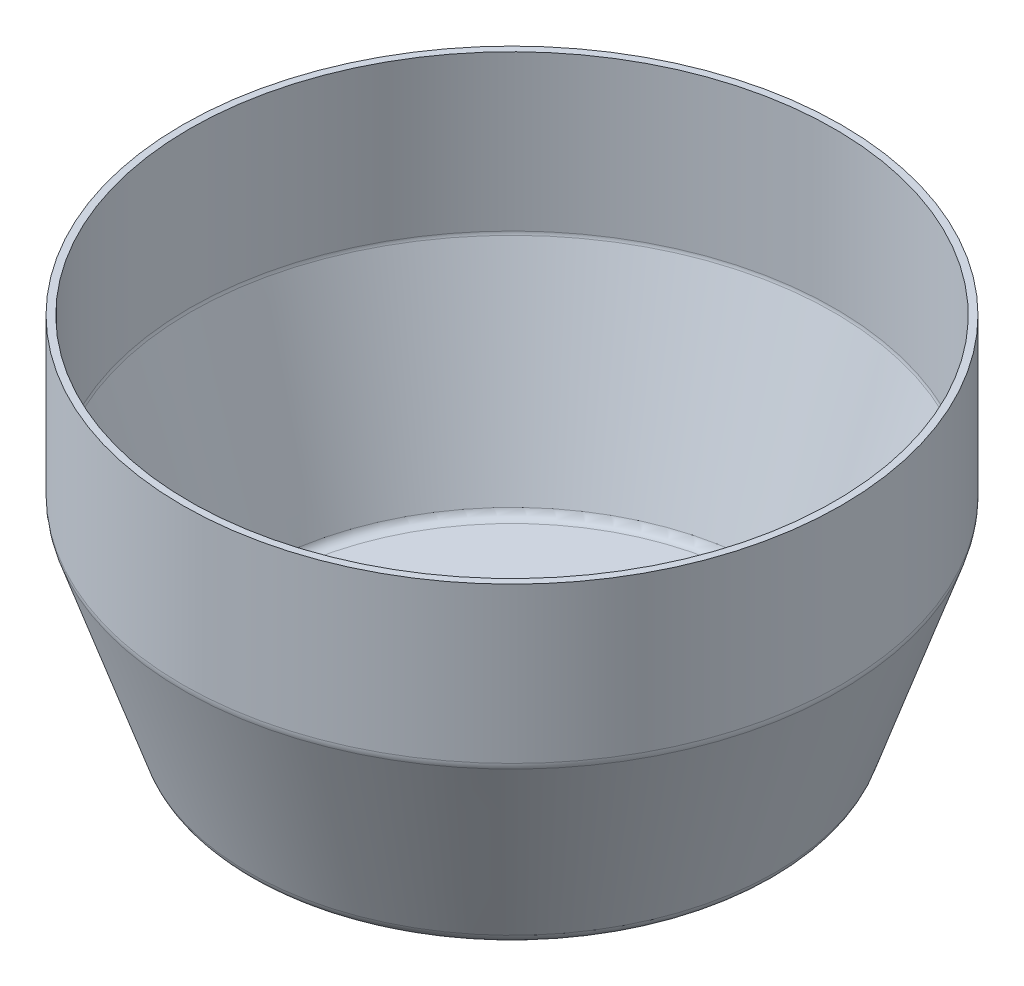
ISO-10303-21;
HEADER;
FILE_DESCRIPTION(('STEP AP214'),'2;1');
FILE_NAME('part.step','',(''),(''),'','','');
FILE_SCHEMA(('AUTOMOTIVE_DESIGN { 1 0 10303 214 1 1 1 1 }'));
ENDSEC;
DATA;
#1=APPLICATION_CONTEXT('core data for automotive mechanical design processes');
#2=APPLICATION_PROTOCOL_DEFINITION('international standard','automotive_design',2000,#1);
#3=PRODUCT_CONTEXT('',#1,'mechanical');
#4=PRODUCT('Part','Part','',(#3));
#5=PRODUCT_RELATED_PRODUCT_CATEGORY('part','',(#4));
#6=PRODUCT_DEFINITION_FORMATION('','',#4);
#7=PRODUCT_DEFINITION_CONTEXT('part definition',#1,'design');
#8=PRODUCT_DEFINITION('design','',#6,#7);
#9=PRODUCT_DEFINITION_SHAPE('','',#8);
#10=(LENGTH_UNIT() NAMED_UNIT(*) SI_UNIT(.MILLI.,.METRE.));
#11=(NAMED_UNIT(*) PLANE_ANGLE_UNIT() SI_UNIT($,.RADIAN.));
#12=(NAMED_UNIT(*) SI_UNIT($,.STERADIAN.) SOLID_ANGLE_UNIT());
#13=UNCERTAINTY_MEASURE_WITH_UNIT(LENGTH_MEASURE(1.E-05),#10,'distance_accuracy_value','');
#14=(GEOMETRIC_REPRESENTATION_CONTEXT(3) GLOBAL_UNCERTAINTY_ASSIGNED_CONTEXT((#13)) GLOBAL_UNIT_ASSIGNED_CONTEXT((#10,
#11,#12)) REPRESENTATION_CONTEXT('',''));
#15=CARTESIAN_POINT('',(0.,0.,0.));
#16=DIRECTION('',(0.,0.,1.));
#17=DIRECTION('',(1.,0.,0.));
#18=AXIS2_PLACEMENT_3D('',#15,#16,#17);
#19=CARTESIAN_POINT('',(-95.5,0.,0.));
#20=DIRECTION('',(0.,1.,0.));
#21=DIRECTION('',(-1.,0.,0.));
#22=AXIS2_PLACEMENT_3D('',#19,#20,#21);
#23=PLANE('',#22);
#24=CARTESIAN_POINT('',(0.,0.,0.));
#25=DIRECTION('',(0.,1.,0.));
#26=DIRECTION('',(-1.,0.,0.));
#27=AXIS2_PLACEMENT_3D('',#24,#25,#26);
#28=CIRCLE('',#27,95.5);
#29=CARTESIAN_POINT('',(-95.5,0.,0.));
#30=VERTEX_POINT('',#29);
#31=EDGE_CURVE('E66',#30,#30,#28,.T.);
#32=ORIENTED_EDGE('',*,*,#31,.T.);
#33=EDGE_LOOP('',(#32));
#34=FACE_BOUND('',#33,.T.);
#35=CARTESIAN_POINT('',(0.,0.,0.));
#36=DIRECTION('',(0.,1.,0.));
#37=DIRECTION('',(-1.,0.,0.));
#38=AXIS2_PLACEMENT_3D('',#35,#36,#37);
#39=CIRCLE('',#38,93.5);
#40=CARTESIAN_POINT('',(-93.5,0.,0.));
#41=VERTEX_POINT('',#40);
#42=EDGE_CURVE('E10',#41,#41,#39,.T.);
#43=ORIENTED_EDGE('',*,*,#42,.F.);
#44=EDGE_LOOP('',(#43));
#45=FACE_BOUND('',#44,.T.);
#46=ADVANCED_FACE('F32',(#34,#45),#23,.T.);
#47=CARTESIAN_POINT('',(0.,38.398623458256,0.));
#48=DIRECTION('',(0.,1.,0.));
#49=DIRECTION('',(-1.,0.,0.));
#50=AXIS2_PLACEMENT_3D('',#47,#48,#49);
#51=CYLINDRICAL_SURFACE('',#50,93.5);
#52=ORIENTED_EDGE('',*,*,#42,.T.);
#53=EDGE_LOOP('',(#52));
#54=FACE_BOUND('',#53,.T.);
#55=CARTESIAN_POINT('',(0.,-45.,0.));
#56=DIRECTION('',(0.,1.,0.));
#57=DIRECTION('',(-1.,0.,0.));
#58=AXIS2_PLACEMENT_3D('',#55,#56,#57);
#59=CIRCLE('',#58,93.5);
#60=CARTESIAN_POINT('',(-93.5,-45.,0.));
#61=VERTEX_POINT('',#60);
#62=EDGE_CURVE('E38',#61,#61,#59,.T.);
#63=ORIENTED_EDGE('',*,*,#62,.F.);
#64=EDGE_LOOP('',(#63));
#65=FACE_BOUND('',#64,.T.);
#66=ADVANCED_FACE('F160',(#54,#65),#51,.F.);
#67=CARTESIAN_POINT('',(0.,-45.,0.));
#68=DIRECTION('',(0.,1.,0.));
#69=DIRECTION('',(-1.,0.,0.));
#70=AXIS2_PLACEMENT_3D('',#67,#68,#69);
#71=TOROIDAL_SURFACE('',#70,90.5,3.);
#72=ORIENTED_EDGE('',*,*,#62,.T.);
#73=EDGE_LOOP('',(#72));
#74=FACE_BOUND('',#73,.T.);
#75=CARTESIAN_POINT('',(0.,-45.9697705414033,0.));
#76=DIRECTION('',(0.,1.,0.));
#77=DIRECTION('',(-1.,0.,0.));
#78=AXIS2_PLACEMENT_3D('',#75,#76,#77);
#79=CIRCLE('',#78,93.338933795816);
#80=CARTESIAN_POINT('',(-93.338933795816,-45.9697705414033,0.));
#81=VERTEX_POINT('',#80);
#82=EDGE_CURVE('E42',#81,#81,#79,.T.);
#83=ORIENTED_EDGE('',*,*,#82,.F.);
#84=EDGE_LOOP('',(#83));
#85=FACE_BOUND('',#84,.T.);
#86=ADVANCED_FACE('F156',(#74,#85),#71,.F.);
#87=CARTESIAN_POINT('',(0.,-100.969770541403,0.));
#88=DIRECTION('',(0.,1.,0.));
#89=DIRECTION('',(-1.,0.,0.));
#90=AXIS2_PLACEMENT_3D('',#87,#88,#89);
#91=CONICAL_SURFACE('',#90,74.551112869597,0.329169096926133);
#92=ORIENTED_EDGE('',*,*,#82,.T.);
#93=EDGE_LOOP('',(#92));
#94=FACE_BOUND('',#93,.T.);
#95=CARTESIAN_POINT('',(0.,-100.969770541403,0.));
#96=DIRECTION('',(0.,1.,0.));
#97=DIRECTION('',(-1.,0.,0.));
#98=AXIS2_PLACEMENT_3D('',#95,#96,#97);
#99=CIRCLE('',#98,74.551112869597);
#100=CARTESIAN_POINT('',(-74.551112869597,-100.969770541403,0.));
#101=VERTEX_POINT('',#100);
#102=EDGE_CURVE('E46',#101,#101,#99,.T.);
#103=ORIENTED_EDGE('',*,*,#102,.F.);
#104=EDGE_LOOP('',(#103));
#105=FACE_BOUND('',#104,.T.);
#106=ADVANCED_FACE('F150',(#94,#105),#91,.F.);
#107=CARTESIAN_POINT('',(0.,-100.,0.));
#108=DIRECTION('',(0.,1.,0.));
#109=DIRECTION('',(-1.,0.,0.));
#110=AXIS2_PLACEMENT_3D('',#107,#108,#109);
#111=TOROIDAL_SURFACE('',#110,71.712179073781,3.);
#112=ORIENTED_EDGE('',*,*,#102,.T.);
#113=EDGE_LOOP('',(#112));
#114=FACE_BOUND('',#113,.T.);
#115=CARTESIAN_POINT('',(0.,-103.,0.));
#116=DIRECTION('',(0.,1.,0.));
#117=DIRECTION('',(-1.,0.,0.));
#118=AXIS2_PLACEMENT_3D('',#115,#116,#117);
#119=CIRCLE('',#118,71.712179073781);
#120=CARTESIAN_POINT('',(-71.712179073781,-103.,0.));
#121=VERTEX_POINT('',#120);
#122=EDGE_CURVE('E51',#121,#121,#119,.T.);
#123=ORIENTED_EDGE('',*,*,#122,.F.);
#124=EDGE_LOOP('',(#123));
#125=FACE_BOUND('',#124,.T.);
#126=ADVANCED_FACE('F131',(#114,#125),#111,.F.);
#127=CARTESIAN_POINT('',(-71.712179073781,-103.,0.));
#128=DIRECTION('',(0.,1.,0.));
#129=DIRECTION('',(-1.,0.,0.));
#130=AXIS2_PLACEMENT_3D('',#127,#128,#129);
#131=PLANE('',#130);
#132=CARTESIAN_POINT('',(-60.,-103.,0.));
#133=DIRECTION('',(0.,1.,0.));
#134=DIRECTION('',(0.,0.,1.));
#135=AXIS2_PLACEMENT_3D('',#132,#133,#134);
#136=CIRCLE('',#135,8.);
#137=CARTESIAN_POINT('',(-60.,-103.,8.00000000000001));
#138=VERTEX_POINT('',#137);
#139=EDGE_CURVE('E112',#138,#138,#136,.T.);
#140=ORIENTED_EDGE('',*,*,#139,.F.);
#141=EDGE_LOOP('',(#140));
#142=FACE_BOUND('',#141,.T.);
#143=CARTESIAN_POINT('',(-21.0000000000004,-103.,36.3730669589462));
#144=DIRECTION('',(0.,1.,0.));
#145=DIRECTION('',(0.866025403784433,0.,0.50000000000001));
#146=AXIS2_PLACEMENT_3D('',#143,#144,#145);
#147=CIRCLE('',#146,2.75);
#148=CARTESIAN_POINT('',(-18.6184301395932,-103.,37.7480669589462));
#149=VERTEX_POINT('',#148);
#150=EDGE_CURVE('E106',#149,#149,#147,.T.);
#151=ORIENTED_EDGE('',*,*,#150,.F.);
#152=EDGE_LOOP('',(#151));
#153=FACE_BOUND('',#152,.T.);
#154=CARTESIAN_POINT('',(20.9999999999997,-103.,36.3730669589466));
#155=DIRECTION('',(0.,1.,0.));
#156=DIRECTION('',(0.866025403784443,0.,-0.499999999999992));
#157=AXIS2_PLACEMENT_3D('',#154,#155,#156);
#158=CIRCLE('',#157,2.75);
#159=CARTESIAN_POINT('',(23.3815698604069,-103.,34.9980669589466));
#160=VERTEX_POINT('',#159);
#161=EDGE_CURVE('E100',#160,#160,#158,.T.);
#162=ORIENTED_EDGE('',*,*,#161,.F.);
#163=EDGE_LOOP('',(#162));
#164=FACE_BOUND('',#163,.T.);
#165=CARTESIAN_POINT('',(42.,-103.,2.88141255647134E-13));
#166=DIRECTION('',(0.,1.,0.));
#167=DIRECTION('',(0.,0.,-1.));
#168=AXIS2_PLACEMENT_3D('',#165,#166,#167);
#169=CIRCLE('',#168,2.75);
#170=CARTESIAN_POINT('',(42.,-103.,-2.74999999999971));
#171=VERTEX_POINT('',#170);
#172=EDGE_CURVE('E94',#171,#171,#169,.T.);
#173=ORIENTED_EDGE('',*,*,#172,.F.);
#174=EDGE_LOOP('',(#173));
#175=FACE_BOUND('',#174,.T.);
#176=CARTESIAN_POINT('',(21.0000000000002,-103.,-36.3730669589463));
#177=DIRECTION('',(0.,1.,0.));
#178=DIRECTION('',(-0.866025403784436,0.,-0.500000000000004));
#179=AXIS2_PLACEMENT_3D('',#176,#177,#178);
#180=CIRCLE('',#179,2.75);
#181=CARTESIAN_POINT('',(18.618430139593,-103.,-37.7480669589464));
#182=VERTEX_POINT('',#181);
#183=EDGE_CURVE('E88',#182,#182,#180,.T.);
#184=ORIENTED_EDGE('',*,*,#183,.F.);
#185=EDGE_LOOP('',(#184));
#186=FACE_BOUND('',#185,.T.);
#187=CARTESIAN_POINT('',(-20.9999999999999,-103.,-36.3730669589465));
#188=DIRECTION('',(0.,1.,0.));
#189=DIRECTION('',(-0.86602540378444,0.,0.499999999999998));
#190=AXIS2_PLACEMENT_3D('',#187,#188,#189);
#191=CIRCLE('',#190,2.75);
#192=CARTESIAN_POINT('',(-23.3815698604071,-103.,-34.9980669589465));
#193=VERTEX_POINT('',#192);
#194=EDGE_CURVE('E82',#193,#193,#191,.T.);
#195=ORIENTED_EDGE('',*,*,#194,.F.);
#196=EDGE_LOOP('',(#195));
#197=FACE_BOUND('',#196,.T.);
#198=CARTESIAN_POINT('',(-42.,-103.,0.));
#199=DIRECTION('',(0.,1.,0.));
#200=DIRECTION('',(0.,0.,1.));
#201=AXIS2_PLACEMENT_3D('',#198,#199,#200);
#202=CIRCLE('',#201,2.75);
#203=CARTESIAN_POINT('',(-42.,-103.,2.75000000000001));
#204=VERTEX_POINT('',#203);
#205=EDGE_CURVE('E76',#204,#204,#202,.T.);
#206=ORIENTED_EDGE('',*,*,#205,.F.);
#207=EDGE_LOOP('',(#206));
#208=FACE_BOUND('',#207,.T.);
#209=CARTESIAN_POINT('',(0.,-103.,0.));
#210=DIRECTION('',(0.,1.,0.));
#211=DIRECTION('',(0.,0.,1.));
#212=AXIS2_PLACEMENT_3D('',#209,#210,#211);
#213=CIRCLE('',#212,30.25);
#214=CARTESIAN_POINT('',(0.,-103.,30.25));
#215=VERTEX_POINT('',#214);
#216=EDGE_CURVE('E70',#215,#215,#213,.T.);
#217=ORIENTED_EDGE('',*,*,#216,.F.);
#218=EDGE_LOOP('',(#217));
#219=FACE_BOUND('',#218,.T.);
#220=ORIENTED_EDGE('',*,*,#122,.T.);
#221=EDGE_LOOP('',(#220));
#222=FACE_BOUND('',#221,.T.);
#223=ADVANCED_FACE('F128',(#142,#153,#164,#175,#186,#197,#208,#219,#222),#131,.T.);
#224=CARTESIAN_POINT('',(-71.712179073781,-105.,0.));
#225=DIRECTION('',(0.,-1.,0.));
#226=DIRECTION('',(1.,0.,0.));
#227=AXIS2_PLACEMENT_3D('',#224,#225,#226);
#228=PLANE('',#227);
#229=CARTESIAN_POINT('',(-60.,-105.,0.));
#230=DIRECTION('',(0.,1.,0.));
#231=DIRECTION('',(0.,0.,1.));
#232=AXIS2_PLACEMENT_3D('',#229,#230,#231);
#233=CIRCLE('',#232,8.);
#234=CARTESIAN_POINT('',(-60.,-105.,8.00000000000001));
#235=VERTEX_POINT('',#234);
#236=EDGE_CURVE('E109',#235,#235,#233,.T.);
#237=ORIENTED_EDGE('',*,*,#236,.T.);
#238=EDGE_LOOP('',(#237));
#239=FACE_BOUND('',#238,.T.);
#240=CARTESIAN_POINT('',(-21.0000000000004,-105.,36.3730669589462));
#241=DIRECTION('',(0.,1.,0.));
#242=DIRECTION('',(0.866025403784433,0.,0.50000000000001));
#243=AXIS2_PLACEMENT_3D('',#240,#241,#242);
#244=CIRCLE('',#243,2.75);
#245=CARTESIAN_POINT('',(-18.6184301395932,-105.,37.7480669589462));
#246=VERTEX_POINT('',#245);
#247=EDGE_CURVE('E103',#246,#246,#244,.T.);
#248=ORIENTED_EDGE('',*,*,#247,.T.);
#249=EDGE_LOOP('',(#248));
#250=FACE_BOUND('',#249,.T.);
#251=CARTESIAN_POINT('',(20.9999999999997,-105.,36.3730669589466));
#252=DIRECTION('',(0.,1.,0.));
#253=DIRECTION('',(0.866025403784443,0.,-0.499999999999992));
#254=AXIS2_PLACEMENT_3D('',#251,#252,#253);
#255=CIRCLE('',#254,2.75);
#256=CARTESIAN_POINT('',(23.3815698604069,-105.,34.9980669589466));
#257=VERTEX_POINT('',#256);
#258=EDGE_CURVE('E97',#257,#257,#255,.T.);
#259=ORIENTED_EDGE('',*,*,#258,.T.);
#260=EDGE_LOOP('',(#259));
#261=FACE_BOUND('',#260,.T.);
#262=CARTESIAN_POINT('',(42.,-105.,2.88141255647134E-13));
#263=DIRECTION('',(0.,1.,0.));
#264=DIRECTION('',(0.,0.,-1.));
#265=AXIS2_PLACEMENT_3D('',#262,#263,#264);
#266=CIRCLE('',#265,2.75);
#267=CARTESIAN_POINT('',(42.,-105.,-2.74999999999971));
#268=VERTEX_POINT('',#267);
#269=EDGE_CURVE('E91',#268,#268,#266,.T.);
#270=ORIENTED_EDGE('',*,*,#269,.T.);
#271=EDGE_LOOP('',(#270));
#272=FACE_BOUND('',#271,.T.);
#273=CARTESIAN_POINT('',(21.0000000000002,-105.,-36.3730669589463));
#274=DIRECTION('',(0.,1.,0.));
#275=DIRECTION('',(-0.866025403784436,0.,-0.500000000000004));
#276=AXIS2_PLACEMENT_3D('',#273,#274,#275);
#277=CIRCLE('',#276,2.75);
#278=CARTESIAN_POINT('',(18.618430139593,-105.,-37.7480669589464));
#279=VERTEX_POINT('',#278);
#280=EDGE_CURVE('E85',#279,#279,#277,.T.);
#281=ORIENTED_EDGE('',*,*,#280,.T.);
#282=EDGE_LOOP('',(#281));
#283=FACE_BOUND('',#282,.T.);
#284=CARTESIAN_POINT('',(-20.9999999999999,-105.,-36.3730669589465));
#285=DIRECTION('',(0.,1.,0.));
#286=DIRECTION('',(-0.86602540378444,0.,0.499999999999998));
#287=AXIS2_PLACEMENT_3D('',#284,#285,#286);
#288=CIRCLE('',#287,2.75);
#289=CARTESIAN_POINT('',(-23.3815698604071,-105.,-34.9980669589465));
#290=VERTEX_POINT('',#289);
#291=EDGE_CURVE('E79',#290,#290,#288,.T.);
#292=ORIENTED_EDGE('',*,*,#291,.T.);
#293=EDGE_LOOP('',(#292));
#294=FACE_BOUND('',#293,.T.);
#295=CARTESIAN_POINT('',(-42.,-105.,0.));
#296=DIRECTION('',(0.,1.,0.));
#297=DIRECTION('',(0.,0.,1.));
#298=AXIS2_PLACEMENT_3D('',#295,#296,#297);
#299=CIRCLE('',#298,2.75);
#300=CARTESIAN_POINT('',(-42.,-105.,2.75000000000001));
#301=VERTEX_POINT('',#300);
#302=EDGE_CURVE('E73',#301,#301,#299,.T.);
#303=ORIENTED_EDGE('',*,*,#302,.T.);
#304=EDGE_LOOP('',(#303));
#305=FACE_BOUND('',#304,.T.);
#306=CARTESIAN_POINT('',(0.,-105.,0.));
#307=DIRECTION('',(0.,1.,0.));
#308=DIRECTION('',(0.,0.,1.));
#309=AXIS2_PLACEMENT_3D('',#306,#307,#308);
#310=CIRCLE('',#309,30.25);
#311=CARTESIAN_POINT('',(0.,-105.,30.25));
#312=VERTEX_POINT('',#311);
#313=EDGE_CURVE('E69',#312,#312,#310,.T.);
#314=ORIENTED_EDGE('',*,*,#313,.T.);
#315=EDGE_LOOP('',(#314));
#316=FACE_BOUND('',#315,.T.);
#317=CARTESIAN_POINT('',(0.,-105.,0.));
#318=DIRECTION('',(0.,1.,0.));
#319=DIRECTION('',(-1.,0.,0.));
#320=AXIS2_PLACEMENT_3D('',#317,#318,#319);
#321=CIRCLE('',#320,71.712179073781);
#322=CARTESIAN_POINT('',(-71.712179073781,-105.,0.));
#323=VERTEX_POINT('',#322);
#324=EDGE_CURVE('E54',#323,#323,#321,.T.);
#325=ORIENTED_EDGE('',*,*,#324,.F.);
#326=EDGE_LOOP('',(#325));
#327=FACE_BOUND('',#326,.T.);
#328=ADVANCED_FACE('F118',(#239,#250,#261,#272,#283,#294,#305,#316,#327),#228,.T.);
#329=CARTESIAN_POINT('',(0.,-100.,0.));
#330=DIRECTION('',(0.,1.,0.));
#331=DIRECTION('',(-1.,0.,0.));
#332=AXIS2_PLACEMENT_3D('',#329,#330,#331);
#333=TOROIDAL_SURFACE('',#332,71.712179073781,5.00000000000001);
#334=ORIENTED_EDGE('',*,*,#324,.T.);
#335=EDGE_LOOP('',(#334));
#336=FACE_BOUND('',#335,.T.);
#337=CARTESIAN_POINT('',(0.,-101.616284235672,0.));
#338=DIRECTION('',(0.,1.,0.));
#339=DIRECTION('',(-1.,0.,0.));
#340=AXIS2_PLACEMENT_3D('',#337,#338,#339);
#341=CIRCLE('',#340,76.443735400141);
#342=CARTESIAN_POINT('',(-76.443735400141,-101.616284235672,0.));
#343=VERTEX_POINT('',#342);
#344=EDGE_CURVE('E57',#343,#343,#341,.T.);
#345=ORIENTED_EDGE('',*,*,#344,.F.);
#346=EDGE_LOOP('',(#345));
#347=FACE_BOUND('',#346,.T.);
#348=ADVANCED_FACE('F188',(#336,#347),#333,.T.);
#349=CARTESIAN_POINT('',(0.,-46.6162842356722,0.));
#350=DIRECTION('',(0.,1.,0.));
#351=DIRECTION('',(-1.,0.,0.));
#352=AXIS2_PLACEMENT_3D('',#349,#350,#351);
#353=CONICAL_SURFACE('',#352,95.23155632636,0.329169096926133);
#354=ORIENTED_EDGE('',*,*,#344,.T.);
#355=EDGE_LOOP('',(#354));
#356=FACE_BOUND('',#355,.T.);
#357=CARTESIAN_POINT('',(0.,-46.6162842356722,0.));
#358=DIRECTION('',(0.,1.,0.));
#359=DIRECTION('',(-1.,0.,0.));
#360=AXIS2_PLACEMENT_3D('',#357,#358,#359);
#361=CIRCLE('',#360,95.23155632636);
#362=CARTESIAN_POINT('',(-95.23155632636,-46.6162842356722,0.));
#363=VERTEX_POINT('',#362);
#364=EDGE_CURVE('E60',#363,#363,#361,.T.);
#365=ORIENTED_EDGE('',*,*,#364,.F.);
#366=EDGE_LOOP('',(#365));
#367=FACE_BOUND('',#366,.T.);
#368=ADVANCED_FACE('F181',(#356,#367),#353,.T.);
#369=CARTESIAN_POINT('',(0.,-45.,0.));
#370=DIRECTION('',(0.,1.,0.));
#371=DIRECTION('',(-1.,0.,0.));
#372=AXIS2_PLACEMENT_3D('',#369,#370,#371);
#373=TOROIDAL_SURFACE('',#372,90.5,5.00000000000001);
#374=ORIENTED_EDGE('',*,*,#364,.T.);
#375=EDGE_LOOP('',(#374));
#376=FACE_BOUND('',#375,.T.);
#377=CARTESIAN_POINT('',(0.,-45.,0.));
#378=DIRECTION('',(0.,1.,0.));
#379=DIRECTION('',(-1.,0.,0.));
#380=AXIS2_PLACEMENT_3D('',#377,#378,#379);
#381=CIRCLE('',#380,95.5);
#382=CARTESIAN_POINT('',(-95.5,-45.,0.));
#383=VERTEX_POINT('',#382);
#384=EDGE_CURVE('E63',#383,#383,#381,.T.);
#385=ORIENTED_EDGE('',*,*,#384,.F.);
#386=EDGE_LOOP('',(#385));
#387=FACE_BOUND('',#386,.T.);
#388=ADVANCED_FACE('F171',(#376,#387),#373,.T.);
#389=CARTESIAN_POINT('',(0.,38.398623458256,0.));
#390=DIRECTION('',(0.,1.,0.));
#391=DIRECTION('',(-1.,0.,0.));
#392=AXIS2_PLACEMENT_3D('',#389,#390,#391);
#393=CYLINDRICAL_SURFACE('',#392,95.5);
#394=ORIENTED_EDGE('',*,*,#384,.T.);
#395=EDGE_LOOP('',(#394));
#396=FACE_BOUND('',#395,.T.);
#397=ORIENTED_EDGE('',*,*,#31,.F.);
#398=EDGE_LOOP('',(#397));
#399=FACE_BOUND('',#398,.T.);
#400=ADVANCED_FACE('F168',(#396,#399),#393,.T.);
#401=CARTESIAN_POINT('',(0.,-105.,0.));
#402=DIRECTION('',(0.,1.,0.));
#403=DIRECTION('',(0.,0.,1.));
#404=AXIS2_PLACEMENT_3D('',#401,#402,#403);
#405=CYLINDRICAL_SURFACE('',#404,30.25);
#406=ORIENTED_EDGE('',*,*,#313,.F.);
#407=EDGE_LOOP('',(#406));
#408=FACE_BOUND('',#407,.T.);
#409=ORIENTED_EDGE('',*,*,#216,.T.);
#410=EDGE_LOOP('',(#409));
#411=FACE_BOUND('',#410,.T.);
#412=ADVANCED_FACE('F170',(#408,#411),#405,.F.);
#413=CARTESIAN_POINT('',(-42.,-105.,0.));
#414=DIRECTION('',(0.,1.,0.));
#415=DIRECTION('',(0.,0.,1.));
#416=AXIS2_PLACEMENT_3D('',#413,#414,#415);
#417=CYLINDRICAL_SURFACE('',#416,2.75);
#418=ORIENTED_EDGE('',*,*,#302,.F.);
#419=EDGE_LOOP('',(#418));
#420=FACE_BOUND('',#419,.T.);
#421=ORIENTED_EDGE('',*,*,#205,.T.);
#422=EDGE_LOOP('',(#421));
#423=FACE_BOUND('',#422,.T.);
#424=ADVANCED_FACE('F178',(#420,#423),#417,.F.);
#425=CARTESIAN_POINT('',(-20.9999999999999,-105.,-36.3730669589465));
#426=DIRECTION('',(0.,1.,0.));
#427=DIRECTION('',(0.,0.,1.));
#428=AXIS2_PLACEMENT_3D('',#425,#426,#427);
#429=CYLINDRICAL_SURFACE('',#428,2.75);
#430=ORIENTED_EDGE('',*,*,#291,.F.);
#431=EDGE_LOOP('',(#430));
#432=FACE_BOUND('',#431,.T.);
#433=ORIENTED_EDGE('',*,*,#194,.T.);
#434=EDGE_LOOP('',(#433));
#435=FACE_BOUND('',#434,.T.);
#436=ADVANCED_FACE('F230',(#432,#435),#429,.F.);
#437=CARTESIAN_POINT('',(21.0000000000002,-105.,-36.3730669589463));
#438=DIRECTION('',(0.,1.,0.));
#439=DIRECTION('',(-1.,0.,0.));
#440=AXIS2_PLACEMENT_3D('',#437,#438,#439);
#441=CYLINDRICAL_SURFACE('',#440,2.75);
#442=ORIENTED_EDGE('',*,*,#280,.F.);
#443=EDGE_LOOP('',(#442));
#444=FACE_BOUND('',#443,.T.);
#445=ORIENTED_EDGE('',*,*,#183,.T.);
#446=EDGE_LOOP('',(#445));
#447=FACE_BOUND('',#446,.T.);
#448=ADVANCED_FACE('F239',(#444,#447),#441,.F.);
#449=CARTESIAN_POINT('',(42.,-105.,2.88141255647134E-13));
#450=DIRECTION('',(0.,1.,0.));
#451=DIRECTION('',(-1.,0.,0.));
#452=AXIS2_PLACEMENT_3D('',#449,#450,#451);
#453=CYLINDRICAL_SURFACE('',#452,2.75);
#454=ORIENTED_EDGE('',*,*,#269,.F.);
#455=EDGE_LOOP('',(#454));
#456=FACE_BOUND('',#455,.T.);
#457=ORIENTED_EDGE('',*,*,#172,.T.);
#458=EDGE_LOOP('',(#457));
#459=FACE_BOUND('',#458,.T.);
#460=ADVANCED_FACE('F249',(#456,#459),#453,.F.);
#461=CARTESIAN_POINT('',(20.9999999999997,-105.,36.3730669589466));
#462=DIRECTION('',(0.,1.,0.));
#463=DIRECTION('',(-1.,0.,0.));
#464=AXIS2_PLACEMENT_3D('',#461,#462,#463);
#465=CYLINDRICAL_SURFACE('',#464,2.75);
#466=ORIENTED_EDGE('',*,*,#258,.F.);
#467=EDGE_LOOP('',(#466));
#468=FACE_BOUND('',#467,.T.);
#469=ORIENTED_EDGE('',*,*,#161,.T.);
#470=EDGE_LOOP('',(#469));
#471=FACE_BOUND('',#470,.T.);
#472=ADVANCED_FACE('F259',(#468,#471),#465,.F.);
#473=CARTESIAN_POINT('',(-21.0000000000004,-105.,36.3730669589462));
#474=DIRECTION('',(0.,1.,0.));
#475=DIRECTION('',(0.,0.,1.));
#476=AXIS2_PLACEMENT_3D('',#473,#474,#475);
#477=CYLINDRICAL_SURFACE('',#476,2.75);
#478=ORIENTED_EDGE('',*,*,#247,.F.);
#479=EDGE_LOOP('',(#478));
#480=FACE_BOUND('',#479,.T.);
#481=ORIENTED_EDGE('',*,*,#150,.T.);
#482=EDGE_LOOP('',(#481));
#483=FACE_BOUND('',#482,.T.);
#484=ADVANCED_FACE('F124',(#480,#483),#477,.F.);
#485=CARTESIAN_POINT('',(-60.,-105.,0.));
#486=DIRECTION('',(0.,1.,0.));
#487=DIRECTION('',(0.,0.,1.));
#488=AXIS2_PLACEMENT_3D('',#485,#486,#487);
#489=CYLINDRICAL_SURFACE('',#488,8.);
#490=ORIENTED_EDGE('',*,*,#236,.F.);
#491=EDGE_LOOP('',(#490));
#492=FACE_BOUND('',#491,.T.);
#493=ORIENTED_EDGE('',*,*,#139,.T.);
#494=EDGE_LOOP('',(#493));
#495=FACE_BOUND('',#494,.T.);
#496=ADVANCED_FACE('F121',(#492,#495),#489,.F.);
#497=CLOSED_SHELL('',(#46,#66,#86,#106,#126,#223,#328,#348,#368,#388,#400,#412,#424,#436,#448,
#460,#472,#484,#496));
#498=MANIFOLD_SOLID_BREP('B2',#497);
#499=ADVANCED_BREP_SHAPE_REPRESENTATION('',(#18,#498),#14);
#500=SHAPE_DEFINITION_REPRESENTATION(#9,#499);
ENDSEC;
END-ISO-10303-21;
